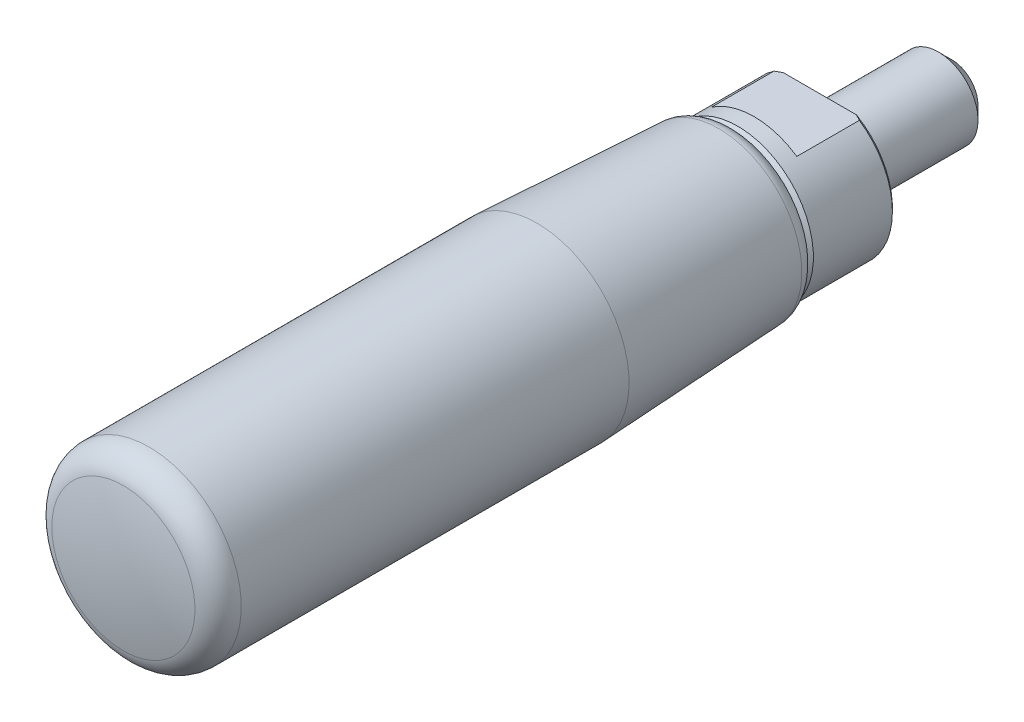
ISO-10303-21;
HEADER;
FILE_DESCRIPTION(('STEP AP214'),'2;1');
FILE_NAME('part.step','',(''),(''),'','','');
FILE_SCHEMA(('AUTOMOTIVE_DESIGN { 1 0 10303 214 1 1 1 1 }'));
ENDSEC;
DATA;
#1=APPLICATION_CONTEXT('core data for automotive mechanical design processes');
#2=APPLICATION_PROTOCOL_DEFINITION('international standard','automotive_design',2000,#1);
#3=PRODUCT_CONTEXT('',#1,'mechanical');
#4=PRODUCT('Part','Part','',(#3));
#5=PRODUCT_RELATED_PRODUCT_CATEGORY('part','',(#4));
#6=PRODUCT_DEFINITION_FORMATION('','',#4);
#7=PRODUCT_DEFINITION_CONTEXT('part definition',#1,'design');
#8=PRODUCT_DEFINITION('design','',#6,#7);
#9=PRODUCT_DEFINITION_SHAPE('','',#8);
#10=(LENGTH_UNIT() NAMED_UNIT(*) SI_UNIT(.MILLI.,.METRE.));
#11=(NAMED_UNIT(*) PLANE_ANGLE_UNIT() SI_UNIT($,.RADIAN.));
#12=(NAMED_UNIT(*) SI_UNIT($,.STERADIAN.) SOLID_ANGLE_UNIT());
#13=UNCERTAINTY_MEASURE_WITH_UNIT(LENGTH_MEASURE(1.E-05),#10,'distance_accuracy_value','');
#14=(GEOMETRIC_REPRESENTATION_CONTEXT(3) GLOBAL_UNCERTAINTY_ASSIGNED_CONTEXT((#13)) GLOBAL_UNIT_ASSIGNED_CONTEXT((#10,
#11,#12)) REPRESENTATION_CONTEXT('',''));
#15=CARTESIAN_POINT('',(0.,0.,0.));
#16=DIRECTION('',(0.,0.,1.));
#17=DIRECTION('',(1.,0.,0.));
#18=AXIS2_PLACEMENT_3D('',#15,#16,#17);
#19=CARTESIAN_POINT('',(0.,6.,0.));
#20=DIRECTION('',(0.,0.,-1.));
#21=DIRECTION('',(-1.,0.,0.));
#22=AXIS2_PLACEMENT_3D('',#19,#20,#21);
#23=PLANE('',#22);
#24=CARTESIAN_POINT('',(0.,0.,0.));
#25=DIRECTION('',(0.,0.,-1.));
#26=DIRECTION('',(-1.,0.,0.));
#27=AXIS2_PLACEMENT_3D('',#24,#25,#26);
#28=CIRCLE('',#27,6.);
#29=CARTESIAN_POINT('',(-6.,0.,0.));
#30=VERTEX_POINT('',#29);
#31=EDGE_CURVE('E170',#30,#30,#28,.T.);
#32=ORIENTED_EDGE('',*,*,#31,.F.);
#33=EDGE_LOOP('',(#32));
#34=FACE_BOUND('',#33,.T.);
#35=CARTESIAN_POINT('',(0.,0.,0.));
#36=DIRECTION('',(0.,0.,-1.));
#37=DIRECTION('',(-1.,0.,0.));
#38=AXIS2_PLACEMENT_3D('',#35,#36,#37);
#39=CIRCLE('',#38,11.);
#40=CARTESIAN_POINT('',(5.54526825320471,9.4999999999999,0.));
#41=VERTEX_POINT('',#40);
#42=CARTESIAN_POINT('',(5.54526825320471,-9.5,0.));
#43=VERTEX_POINT('',#42);
#44=EDGE_CURVE('E139',#41,#43,#39,.T.);
#45=ORIENTED_EDGE('',*,*,#44,.T.);
#46=DIRECTION('',(-1.,0.,0.));
#47=VECTOR('',#46,1.);
#48=CARTESIAN_POINT('',(0.,-9.5,0.));
#49=LINE('',#48,#47);
#50=CARTESIAN_POINT('',(-5.5452682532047,-9.5,0.));
#51=VERTEX_POINT('',#50);
#52=EDGE_CURVE('E79',#43,#51,#49,.T.);
#53=ORIENTED_EDGE('',*,*,#52,.T.);
#54=CARTESIAN_POINT('',(-5.54526825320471,9.4999999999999,0.));
#55=VERTEX_POINT('',#54);
#56=EDGE_CURVE('E37',#51,#55,#39,.T.);
#57=ORIENTED_EDGE('',*,*,#56,.T.);
#58=DIRECTION('',(-1.,0.,0.));
#59=VECTOR('',#58,1.);
#60=CARTESIAN_POINT('',(0.,9.4999999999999,0.));
#61=LINE('',#60,#59);
#62=EDGE_CURVE('E147',#41,#55,#61,.T.);
#63=ORIENTED_EDGE('',*,*,#62,.F.);
#64=EDGE_LOOP('',(#45,#53,#57,#63));
#65=FACE_BOUND('',#64,.T.);
#66=ADVANCED_FACE('F14',(#34,#65),#23,.T.);
#67=CARTESIAN_POINT('',(-1.04996420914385E-13,0.,-25.));
#68=DIRECTION('',(0.,0.,-1.));
#69=DIRECTION('',(-1.,0.,0.));
#70=AXIS2_PLACEMENT_3D('',#67,#68,#69);
#71=CYLINDRICAL_SURFACE('',#70,11.5);
#72=CARTESIAN_POINT('',(0.,0.,12.5));
#73=DIRECTION('',(0.,0.,-1.));
#74=DIRECTION('',(-1.,0.,0.));
#75=AXIS2_PLACEMENT_3D('',#72,#73,#74);
#76=CIRCLE('',#75,11.5);
#77=CARTESIAN_POINT('',(-11.4999999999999,0.,12.5));
#78=VERTEX_POINT('',#77);
#79=EDGE_CURVE('E153',#78,#78,#76,.T.);
#80=ORIENTED_EDGE('',*,*,#79,.T.);
#81=EDGE_LOOP('',(#80));
#82=FACE_BOUND('',#81,.T.);
#83=CARTESIAN_POINT('',(0.,0.,0.5));
#84=DIRECTION('',(0.,0.,-1.));
#85=DIRECTION('',(-1.,0.,0.));
#86=AXIS2_PLACEMENT_3D('',#83,#84,#85);
#87=CIRCLE('',#86,11.5);
#88=CARTESIAN_POINT('',(-6.48074069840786,-9.5,0.500000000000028));
#89=VERTEX_POINT('',#88);
#90=CARTESIAN_POINT('',(-6.48074069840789,9.4999999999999,0.499999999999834));
#91=VERTEX_POINT('',#90);
#92=EDGE_CURVE('E146',#89,#91,#87,.T.);
#93=ORIENTED_EDGE('',*,*,#92,.F.);
#94=DIRECTION('',(0.,0.,-1.));
#95=VECTOR('',#94,1.);
#96=CARTESIAN_POINT('',(-6.48074069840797,-9.5,-25.));
#97=LINE('',#96,#95);
#98=CARTESIAN_POINT('',(-6.48074069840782,-9.5,10.));
#99=VERTEX_POINT('',#98);
#100=EDGE_CURVE('E29',#89,#99,#97,.F.);
#101=ORIENTED_EDGE('',*,*,#100,.T.);
#102=CARTESIAN_POINT('',(0.,0.,10.));
#103=DIRECTION('',(0.,0.,1.));
#104=DIRECTION('',(0.,1.,0.));
#105=AXIS2_PLACEMENT_3D('',#102,#103,#104);
#106=CIRCLE('',#105,11.5);
#107=CARTESIAN_POINT('',(6.4807406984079,-9.5,9.99999999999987));
#108=VERTEX_POINT('',#107);
#109=EDGE_CURVE('E83',#108,#99,#106,.F.);
#110=ORIENTED_EDGE('',*,*,#109,.F.);
#111=DIRECTION('',(0.,0.,-1.));
#112=VECTOR('',#111,1.);
#113=CARTESIAN_POINT('',(6.48074069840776,-9.5,-25.));
#114=LINE('',#113,#112);
#115=CARTESIAN_POINT('',(6.4807406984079,-9.5,0.499999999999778));
#116=VERTEX_POINT('',#115);
#117=EDGE_CURVE('E68',#108,#116,#114,.T.);
#118=ORIENTED_EDGE('',*,*,#117,.T.);
#119=CARTESIAN_POINT('',(6.4807406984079,9.4999999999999,0.499999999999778));
#120=VERTEX_POINT('',#119);
#121=EDGE_CURVE('E151',#120,#116,#87,.T.);
#122=ORIENTED_EDGE('',*,*,#121,.F.);
#123=DIRECTION('',(0.,0.,-1.));
#124=VECTOR('',#123,1.);
#125=CARTESIAN_POINT('',(6.48074069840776,9.4999999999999,-25.));
#126=LINE('',#125,#124);
#127=CARTESIAN_POINT('',(6.4807406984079,9.4999999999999,9.99999999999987));
#128=VERTEX_POINT('',#127);
#129=EDGE_CURVE('E144',#128,#120,#126,.T.);
#130=ORIENTED_EDGE('',*,*,#129,.F.);
#131=CARTESIAN_POINT('',(0.,0.,10.));
#132=DIRECTION('',(0.,0.,-1.));
#133=DIRECTION('',(0.,-1.,0.));
#134=AXIS2_PLACEMENT_3D('',#131,#132,#133);
#135=CIRCLE('',#134,11.5);
#136=CARTESIAN_POINT('',(-6.48074069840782,9.4999999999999,10.));
#137=VERTEX_POINT('',#136);
#138=EDGE_CURVE('E132',#128,#137,#135,.F.);
#139=ORIENTED_EDGE('',*,*,#138,.T.);
#140=DIRECTION('',(0.,0.,-1.));
#141=VECTOR('',#140,1.);
#142=CARTESIAN_POINT('',(-6.48074069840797,9.4999999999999,-25.));
#143=LINE('',#142,#141);
#144=EDGE_CURVE('E235',#91,#137,#143,.F.);
#145=ORIENTED_EDGE('',*,*,#144,.F.);
#146=EDGE_LOOP('',(#93,#101,#110,#118,#122,#130,#139,#145));
#147=FACE_BOUND('',#146,.T.);
#148=ADVANCED_FACE('F86',(#82,#147),#71,.T.);
#149=CARTESIAN_POINT('',(0.,0.,0.5));
#150=DIRECTION('',(0.,0.,1.));
#151=DIRECTION('',(1.,0.,0.));
#152=AXIS2_PLACEMENT_3D('',#149,#150,#151);
#153=CONICAL_SURFACE('',#152,11.5,0.785398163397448);
#154=CARTESIAN_POINT('',(2.6150436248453,-9.5,-1.1466526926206));
#155=CARTESIAN_POINT('',(2.81563188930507,-9.5,-1.0934217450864));
#156=CARTESIAN_POINT('',(3.01473887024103,-9.5,-1.03488173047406));
#157=CARTESIAN_POINT('',(3.40980529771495,-9.5,-0.908329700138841));
#158=CARTESIAN_POINT('',(3.60576644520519,-9.5,-0.840323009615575));
#159=CARTESIAN_POINT('',(4.18777598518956,-9.5,-0.624171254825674));
#160=CARTESIAN_POINT('',(4.56920172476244,-9.5,-0.463548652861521));
#161=CARTESIAN_POINT('',(5.31721943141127,-9.5,-0.118204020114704));
#162=CARTESIAN_POINT('',(5.68390242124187,-9.5,0.0663246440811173));
#163=CARTESIAN_POINT('',(6.2262889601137,-9.5,0.357529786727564));
#164=CARTESIAN_POINT('',(6.4058912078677,-9.5,0.457048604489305));
#165=CARTESIAN_POINT('',(6.76270089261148,-9.5,0.660300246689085));
#166=CARTESIAN_POINT('',(6.93990829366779,-9.5,0.764033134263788));
#167=CARTESIAN_POINT('',(7.36366995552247,-9.5,1.01808323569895));
#168=CARTESIAN_POINT('',(7.60914328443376,-9.5,1.17020184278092));
#169=CARTESIAN_POINT('',(8.09622136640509,-9.5,1.48052793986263));
#170=CARTESIAN_POINT('',(8.33782582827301,-9.5,1.63873588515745));
#171=CARTESIAN_POINT('',(8.81766580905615,-9.5,1.96030498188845));
#172=CARTESIAN_POINT('',(9.05590042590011,-9.5,2.1236674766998));
#173=CARTESIAN_POINT('',(9.52934102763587,-9.5,2.45472976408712));
#174=CARTESIAN_POINT('',(9.76454690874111,-9.5,2.62242970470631));
#175=CARTESIAN_POINT('',(10.4668157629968,-9.5,3.13151778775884));
#176=CARTESIAN_POINT('',(10.92986612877,-9.5,3.47844413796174));
#177=CARTESIAN_POINT('',(11.8474959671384,-9.5,4.183117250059));
#178=CARTESIAN_POINT('',(12.3020766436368,-9.5,4.5408624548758));
#179=CARTESIAN_POINT('',(13.2154590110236,-9.5,5.27335739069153));
#180=CARTESIAN_POINT('',(13.6740983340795,-9.5,5.6483091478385));
#181=CARTESIAN_POINT('',(14.5858281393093,-9.5,6.40493510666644));
#182=CARTESIAN_POINT('',(15.038918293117,-9.5,6.78660970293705));
#183=CARTESIAN_POINT('',(15.9386408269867,-9.5,7.55357697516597));
#184=CARTESIAN_POINT('',(16.3852926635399,-9.5,7.93884685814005));
#185=CARTESIAN_POINT('',(17.052492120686,-9.5,8.51987658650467));
#186=CARTESIAN_POINT('',(17.2744147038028,-9.5,8.71406138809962));
#187=CARTESIAN_POINT('',(17.7174228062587,-9.5,9.1033806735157));
#188=CARTESIAN_POINT('',(17.938508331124,-9.5,9.29851515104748));
#189=CARTESIAN_POINT('',(18.1592164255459,-9.5,9.49407575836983));
#190=B_SPLINE_CURVE_WITH_KNOTS('',3,(#154,#155,#156,#157,#158,#159,#160,#161,#162,#163,#164,
#165,#166,#167,#168,#169,#170,#171,#172,#173,#174,#175,#176,#177,#178,#179,#180,#181,#182,#183,
#184,#185,#186,#187,#188,#189),.UNSPECIFIED.,.F.,.F.,(4,2,2,2,2,2,2,2,2,2,2,2,2,2,2,2,2,4),(0.,
0.622411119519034,1.24447352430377,2.48471844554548,3.71549389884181,4.33144062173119,
4.9473965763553,5.81364198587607,6.67995229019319,7.54649026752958,8.41305786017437,
10.1485978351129,11.8838892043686,13.6610078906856,15.4382312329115,17.2077667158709,
18.0924206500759,18.977068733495),.UNSPECIFIED.);
#191=EDGE_CURVE('E73',#43,#116,#190,.T.);
#192=ORIENTED_EDGE('',*,*,#191,.F.);
#193=ORIENTED_EDGE('',*,*,#44,.F.);
#194=CARTESIAN_POINT('',(2.6150436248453,9.4999999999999,-1.1466526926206));
#195=CARTESIAN_POINT('',(2.81563188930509,9.4999999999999,-1.09342174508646));
#196=CARTESIAN_POINT('',(3.01473887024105,9.4999999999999,-1.03488173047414));
#197=CARTESIAN_POINT('',(3.40980529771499,9.4999999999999,-0.908329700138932));
#198=CARTESIAN_POINT('',(3.60576644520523,9.4999999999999,-0.840323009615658));
#199=CARTESIAN_POINT('',(4.18777598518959,9.4999999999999,-0.624171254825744));
#200=CARTESIAN_POINT('',(4.56920172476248,9.4999999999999,-0.463548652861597));
#201=CARTESIAN_POINT('',(5.3172194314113,9.4999999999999,-0.118204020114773));
#202=CARTESIAN_POINT('',(5.6839024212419,9.4999999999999,0.0663246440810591));
#203=CARTESIAN_POINT('',(6.22628896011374,9.4999999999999,0.357529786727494));
#204=CARTESIAN_POINT('',(6.40589120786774,9.4999999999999,0.457048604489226));
#205=CARTESIAN_POINT('',(6.76270089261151,9.4999999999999,0.660300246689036));
#206=CARTESIAN_POINT('',(6.9399082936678,9.4999999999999,0.76403313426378));
#207=CARTESIAN_POINT('',(7.36366995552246,9.4999999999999,1.01808323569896));
#208=CARTESIAN_POINT('',(7.60914328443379,9.4999999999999,1.17020184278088));
#209=CARTESIAN_POINT('',(8.09622136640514,9.4999999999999,1.48052793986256));
#210=CARTESIAN_POINT('',(8.33782582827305,9.4999999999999,1.6387358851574));
#211=CARTESIAN_POINT('',(8.81766580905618,9.4999999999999,1.96030498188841));
#212=CARTESIAN_POINT('',(9.05590042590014,9.4999999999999,2.12366747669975));
#213=CARTESIAN_POINT('',(9.52934102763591,9.4999999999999,2.45472976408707));
#214=CARTESIAN_POINT('',(9.76454690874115,9.4999999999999,2.62242970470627));
#215=CARTESIAN_POINT('',(10.4668157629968,9.4999999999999,3.1315177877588));
#216=CARTESIAN_POINT('',(10.9298661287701,9.4999999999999,3.47844413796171));
#217=CARTESIAN_POINT('',(11.8474959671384,9.4999999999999,4.18311725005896));
#218=CARTESIAN_POINT('',(12.3020766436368,9.4999999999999,4.54086245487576));
#219=CARTESIAN_POINT('',(13.2154590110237,9.4999999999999,5.2733573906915));
#220=CARTESIAN_POINT('',(13.6740983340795,9.4999999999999,5.64830914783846));
#221=CARTESIAN_POINT('',(14.5858281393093,9.4999999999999,6.4049351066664));
#222=CARTESIAN_POINT('',(15.038918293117,9.4999999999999,6.78660970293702));
#223=CARTESIAN_POINT('',(15.9386408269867,9.4999999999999,7.55357697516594));
#224=CARTESIAN_POINT('',(16.3852926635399,9.4999999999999,7.93884685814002));
#225=CARTESIAN_POINT('',(17.052492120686,9.4999999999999,8.51987658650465));
#226=CARTESIAN_POINT('',(17.2744147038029,9.4999999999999,8.71406138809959));
#227=CARTESIAN_POINT('',(17.7174228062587,9.4999999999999,9.10338067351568));
#228=CARTESIAN_POINT('',(17.938508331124,9.4999999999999,9.29851515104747));
#229=CARTESIAN_POINT('',(18.1592164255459,9.4999999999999,9.49407575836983));
#230=B_SPLINE_CURVE_WITH_KNOTS('',3,(#194,#195,#196,#197,#198,#199,#200,#201,#202,#203,#204,
#205,#206,#207,#208,#209,#210,#211,#212,#213,#214,#215,#216,#217,#218,#219,#220,#221,#222,#223,
#224,#225,#226,#227,#228,#229),.UNSPECIFIED.,.F.,.F.,(4,2,2,2,2,2,2,2,2,2,2,2,2,2,2,2,2,4),(0.,
0.622411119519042,1.24447352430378,2.4847184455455,3.71549389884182,4.33144062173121,
4.94739657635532,5.81364198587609,6.67995229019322,7.54649026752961,8.4130578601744,
10.1485978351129,11.8838892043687,13.6610078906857,15.4382312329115,17.2077667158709,
18.0924206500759,18.977068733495),.UNSPECIFIED.);
#231=EDGE_CURVE('E126',#41,#120,#230,.T.);
#232=ORIENTED_EDGE('',*,*,#231,.T.);
#233=ORIENTED_EDGE('',*,*,#121,.T.);
#234=EDGE_LOOP('',(#192,#193,#232,#233));
#235=FACE_BOUND('',#234,.T.);
#236=ADVANCED_FACE('F103',(#235),#153,.T.);
#237=CARTESIAN_POINT('',(-18.1592164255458,-9.5,9.49407575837));
#238=CARTESIAN_POINT('',(-17.9385083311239,-9.5,9.29851515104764));
#239=CARTESIAN_POINT('',(-17.7174228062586,-9.5,9.10338067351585));
#240=CARTESIAN_POINT('',(-17.2744147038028,-9.5,8.71406138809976));
#241=CARTESIAN_POINT('',(-17.0524921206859,-9.5,8.51987658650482));
#242=CARTESIAN_POINT('',(-16.3852926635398,-9.5,7.93884685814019));
#243=CARTESIAN_POINT('',(-15.9386408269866,-9.5,7.5535769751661));
#244=CARTESIAN_POINT('',(-15.0389182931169,-9.5,6.78660970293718));
#245=CARTESIAN_POINT('',(-14.5858281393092,-9.5,6.40493510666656));
#246=CARTESIAN_POINT('',(-13.6740983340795,-9.5,5.64830914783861));
#247=CARTESIAN_POINT('',(-13.2154590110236,-9.5,5.27335739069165));
#248=CARTESIAN_POINT('',(-12.3020766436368,-9.5,4.5408624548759));
#249=CARTESIAN_POINT('',(-11.8474959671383,-9.5,4.1831172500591));
#250=CARTESIAN_POINT('',(-10.92986612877,-9.5,3.47844413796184));
#251=CARTESIAN_POINT('',(-10.4668157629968,-9.5,3.13151778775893));
#252=CARTESIAN_POINT('',(-9.76454690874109,-9.5,2.62242970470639));
#253=CARTESIAN_POINT('',(-9.52934102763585,-9.5,2.4547297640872));
#254=CARTESIAN_POINT('',(-9.05590042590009,-9.5,2.12366747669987));
#255=CARTESIAN_POINT('',(-8.81766580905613,-9.5,1.96030498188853));
#256=CARTESIAN_POINT('',(-8.337825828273,-9.5,1.63873588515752));
#257=CARTESIAN_POINT('',(-8.09622136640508,-9.5,1.4805279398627));
#258=CARTESIAN_POINT('',(-7.60914328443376,-9.5,1.17020184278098));
#259=CARTESIAN_POINT('',(-7.36366995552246,-9.5,1.018083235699));
#260=CARTESIAN_POINT('',(-6.93990829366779,-9.5,0.764033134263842));
#261=CARTESIAN_POINT('',(-6.76270089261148,-9.5,0.66030024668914));
#262=CARTESIAN_POINT('',(-6.40589120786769,-9.5,0.457048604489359));
#263=CARTESIAN_POINT('',(-6.2262889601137,-9.5,0.357529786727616));
#264=CARTESIAN_POINT('',(-5.68390242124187,-9.5,0.0663246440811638));
#265=CARTESIAN_POINT('',(-5.31721943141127,-9.5,-0.118204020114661));
#266=CARTESIAN_POINT('',(-4.56920172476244,-9.5,-0.463548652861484));
#267=CARTESIAN_POINT('',(-4.18777598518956,-9.5,-0.62417125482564));
#268=CARTESIAN_POINT('',(-3.60576644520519,-9.5,-0.840323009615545));
#269=CARTESIAN_POINT('',(-3.40980529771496,-9.5,-0.908329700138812));
#270=CARTESIAN_POINT('',(-3.01473887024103,-9.5,-1.03488173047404));
#271=CARTESIAN_POINT('',(-2.81563188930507,-9.5,-1.09342174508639));
#272=CARTESIAN_POINT('',(-2.61504362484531,-9.5,-1.1466526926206));
#273=B_SPLINE_CURVE_WITH_KNOTS('',3,(#237,#238,#239,#240,#241,#242,#243,#244,#245,#246,#247,
#248,#249,#250,#251,#252,#253,#254,#255,#256,#257,#258,#259,#260,#261,#262,#263,#264,#265,#266,
#267,#268,#269,#270,#271,#272),.UNSPECIFIED.,.F.,.F.,(4,2,2,2,2,2,2,2,2,2,2,2,2,2,2,2,2,4),(0.,
0.884648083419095,1.76930201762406,3.5388375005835,5.31606084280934,7.09317952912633,
8.82847089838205,10.5640108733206,11.4305784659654,12.2971164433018,13.1634267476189,
14.0296721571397,14.6456281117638,15.2615748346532,16.4923502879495,17.7325952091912,
18.3546576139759,18.977068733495),.UNSPECIFIED.);
#274=EDGE_CURVE('E89',#89,#51,#273,.T.);
#275=ORIENTED_EDGE('',*,*,#274,.F.);
#276=ORIENTED_EDGE('',*,*,#92,.T.);
#277=CARTESIAN_POINT('',(-18.1592164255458,9.4999999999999,9.49407575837));
#278=CARTESIAN_POINT('',(-17.938508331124,9.4999999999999,9.29851515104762));
#279=CARTESIAN_POINT('',(-17.7174228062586,9.4999999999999,9.10338067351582));
#280=CARTESIAN_POINT('',(-17.2744147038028,9.4999999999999,8.71406138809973));
#281=CARTESIAN_POINT('',(-17.0524921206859,9.4999999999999,8.51987658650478));
#282=CARTESIAN_POINT('',(-16.3852926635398,9.4999999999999,7.93884685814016));
#283=CARTESIAN_POINT('',(-15.9386408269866,9.4999999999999,7.55357697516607));
#284=CARTESIAN_POINT('',(-15.0389182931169,9.4999999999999,6.78660970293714));
#285=CARTESIAN_POINT('',(-14.5858281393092,9.4999999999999,6.40493510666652));
#286=CARTESIAN_POINT('',(-13.6740983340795,9.4999999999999,5.64830914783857));
#287=CARTESIAN_POINT('',(-13.2154590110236,9.4999999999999,5.27335739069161));
#288=CARTESIAN_POINT('',(-12.3020766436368,9.4999999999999,4.54086245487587));
#289=CARTESIAN_POINT('',(-11.8474959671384,9.4999999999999,4.18311725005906));
#290=CARTESIAN_POINT('',(-10.9298661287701,9.4999999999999,3.4784441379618));
#291=CARTESIAN_POINT('',(-10.4668157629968,9.4999999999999,3.13151778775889));
#292=CARTESIAN_POINT('',(-9.76454690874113,9.4999999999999,2.62242970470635));
#293=CARTESIAN_POINT('',(-9.5293410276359,9.4999999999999,2.45472976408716));
#294=CARTESIAN_POINT('',(-9.05590042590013,9.4999999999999,2.12366747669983));
#295=CARTESIAN_POINT('',(-8.81766580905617,9.4999999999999,1.96030498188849));
#296=CARTESIAN_POINT('',(-8.33782582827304,9.4999999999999,1.63873588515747));
#297=CARTESIAN_POINT('',(-8.09622136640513,9.4999999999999,1.48052793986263));
#298=CARTESIAN_POINT('',(-7.60914328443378,9.4999999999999,1.17020184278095));
#299=CARTESIAN_POINT('',(-7.36366995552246,9.4999999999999,1.01808323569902));
#300=CARTESIAN_POINT('',(-6.9399082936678,9.4999999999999,0.764033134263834));
#301=CARTESIAN_POINT('',(-6.7627008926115,9.4999999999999,0.660300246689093));
#302=CARTESIAN_POINT('',(-6.40589120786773,9.4999999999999,0.457048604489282));
#303=CARTESIAN_POINT('',(-6.22628896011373,9.4999999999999,0.357529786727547));
#304=CARTESIAN_POINT('',(-5.6839024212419,9.4999999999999,0.0663246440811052));
#305=CARTESIAN_POINT('',(-5.3172194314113,9.4999999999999,-0.11820402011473));
#306=CARTESIAN_POINT('',(-4.56920172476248,9.4999999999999,-0.46354865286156));
#307=CARTESIAN_POINT('',(-4.18777598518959,9.4999999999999,-0.624171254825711));
#308=CARTESIAN_POINT('',(-3.60576644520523,9.4999999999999,-0.840323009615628));
#309=CARTESIAN_POINT('',(-3.40980529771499,9.4999999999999,-0.908329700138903));
#310=CARTESIAN_POINT('',(-3.01473887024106,9.4999999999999,-1.03488173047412));
#311=CARTESIAN_POINT('',(-2.81563188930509,9.4999999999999,-1.09342174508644));
#312=CARTESIAN_POINT('',(-2.61504362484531,9.4999999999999,-1.1466526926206));
#313=B_SPLINE_CURVE_WITH_KNOTS('',3,(#277,#278,#279,#280,#281,#282,#283,#284,#285,#286,#287,
#288,#289,#290,#291,#292,#293,#294,#295,#296,#297,#298,#299,#300,#301,#302,#303,#304,#305,#306,
#307,#308,#309,#310,#311,#312),.UNSPECIFIED.,.F.,.F.,(4,2,2,2,2,2,2,2,2,2,2,2,2,2,2,2,2,4),(0.,
0.884648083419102,1.76930201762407,3.53883750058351,5.31606084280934,7.09317952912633,
8.82847089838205,10.5640108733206,11.4305784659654,12.2971164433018,13.1634267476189,
14.0296721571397,14.6456281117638,15.2615748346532,16.4923502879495,17.7325952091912,
18.354657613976,18.977068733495),.UNSPECIFIED.);
#314=EDGE_CURVE('E119',#91,#55,#313,.T.);
#315=ORIENTED_EDGE('',*,*,#314,.T.);
#316=ORIENTED_EDGE('',*,*,#56,.F.);
#317=EDGE_LOOP('',(#275,#276,#315,#316));
#318=FACE_BOUND('',#317,.T.);
#319=ADVANCED_FACE('F142',(#318),#153,.T.);
#320=CARTESIAN_POINT('',(-1.04996420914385E-13,0.,-25.));
#321=DIRECTION('',(0.,0.,-1.));
#322=DIRECTION('',(-1.,0.,0.));
#323=AXIS2_PLACEMENT_3D('',#320,#321,#322);
#324=CYLINDRICAL_SURFACE('',#323,6.);
#325=CARTESIAN_POINT('',(0.,0.,-18.));
#326=DIRECTION('',(0.,0.,-1.));
#327=DIRECTION('',(-1.,0.,0.));
#328=AXIS2_PLACEMENT_3D('',#325,#326,#327);
#329=CIRCLE('',#328,6.);
#330=CARTESIAN_POINT('',(-6.00000000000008,0.,-18.));
#331=VERTEX_POINT('',#330);
#332=EDGE_CURVE('E9',#331,#331,#329,.F.);
#333=ORIENTED_EDGE('',*,*,#332,.T.);
#334=EDGE_LOOP('',(#333));
#335=FACE_BOUND('',#334,.T.);
#336=ORIENTED_EDGE('',*,*,#31,.T.);
#337=EDGE_LOOP('',(#336));
#338=FACE_BOUND('',#337,.T.);
#339=ADVANCED_FACE('F174',(#335,#338),#324,.T.);
#340=CARTESIAN_POINT('',(0.,0.,-20.));
#341=DIRECTION('',(0.,0.,-1.));
#342=DIRECTION('',(-1.,0.,0.));
#343=AXIS2_PLACEMENT_3D('',#340,#341,#342);
#344=PLANE('',#343);
#345=CARTESIAN_POINT('',(0.,0.,-20.));
#346=DIRECTION('',(0.,0.,-1.));
#347=DIRECTION('',(-1.,0.,0.));
#348=AXIS2_PLACEMENT_3D('',#345,#346,#347);
#349=CIRCLE('',#348,4.);
#350=CARTESIAN_POINT('',(-4.00000000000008,0.,-20.));
#351=VERTEX_POINT('',#350);
#352=EDGE_CURVE('E22',#351,#351,#349,.T.);
#353=ORIENTED_EDGE('',*,*,#352,.T.);
#354=EDGE_LOOP('',(#353));
#355=FACE_BOUND('',#354,.T.);
#356=ADVANCED_FACE('F186',(#355),#344,.T.);
#357=CARTESIAN_POINT('',(2.39391839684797E-13,0.,57.));
#358=DIRECTION('',(-1.,0.,0.));
#359=DIRECTION('',(0.,0.,1.));
#360=AXIS2_PLACEMENT_3D('',#357,#358,#359);
#361=SPHERICAL_SURFACE('',#360,50.);
#362=CARTESIAN_POINT('',(2.39391839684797E-13,0.,57.));
#363=DIRECTION('',(0.,0.,-1.));
#364=DIRECTION('',(-1.,0.,0.));
#365=AXIS2_PLACEMENT_3D('',#362,#363,#364);
#366=SPHERICAL_SURFACE('',#365,50.);
#367=CARTESIAN_POINT('',(4.44362605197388E-13,0.,105.804226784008));
#368=DIRECTION('',(0.,0.,-1.));
#369=DIRECTION('',(-1.,0.,0.));
#370=AXIS2_PLACEMENT_3D('',#367,#368,#369);
#371=CIRCLE('',#370,10.8695652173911);
#372=CARTESIAN_POINT('',(-10.8695652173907,0.,105.804226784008));
#373=VERTEX_POINT('',#372);
#374=EDGE_CURVE('E168',#373,#373,#371,.T.);
#375=ORIENTED_EDGE('',*,*,#374,.F.);
#376=EDGE_LOOP('',(#375));
#377=FACE_BOUND('',#376,.T.);
#378=ADVANCED_FACE('F190',(#377),#366,.T.);
#379=CARTESIAN_POINT('',(4.27964943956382E-13,0.,101.899888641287));
#380=DIRECTION('',(0.,0.,-1.));
#381=DIRECTION('',(-1.,0.,0.));
#382=AXIS2_PLACEMENT_3D('',#379,#380,#381);
#383=TOROIDAL_SURFACE('',#382,9.99999999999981,4.);
#384=CARTESIAN_POINT('',(4.27964943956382E-13,0.,101.899888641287));
#385=DIRECTION('',(0.,0.,-1.));
#386=DIRECTION('',(-1.,0.,0.));
#387=AXIS2_PLACEMENT_3D('',#384,#385,#386);
#388=CIRCLE('',#387,13.9999999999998);
#389=CARTESIAN_POINT('',(-13.9999999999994,0.,101.899888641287));
#390=VERTEX_POINT('',#389);
#391=EDGE_CURVE('E165',#390,#390,#388,.T.);
#392=ORIENTED_EDGE('',*,*,#391,.F.);
#393=EDGE_LOOP('',(#392));
#394=FACE_BOUND('',#393,.T.);
#395=ORIENTED_EDGE('',*,*,#374,.T.);
#396=EDGE_LOOP('',(#395));
#397=FACE_BOUND('',#396,.T.);
#398=ADVANCED_FACE('F194',(#394,#397),#383,.T.);
#399=CARTESIAN_POINT('',(-1.04996420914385E-13,0.,-25.));
#400=DIRECTION('',(0.,0.,-1.));
#401=DIRECTION('',(-1.,0.,0.));
#402=AXIS2_PLACEMENT_3D('',#399,#400,#401);
#403=CYLINDRICAL_SURFACE('',#402,13.9999999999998);
#404=CARTESIAN_POINT('',(1.80593843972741E-13,0.,43.));
#405=DIRECTION('',(0.,0.,-1.));
#406=DIRECTION('',(-1.,0.,0.));
#407=AXIS2_PLACEMENT_3D('',#404,#405,#406);
#408=CIRCLE('',#407,13.9999999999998);
#409=CARTESIAN_POINT('',(-13.9999999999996,0.,43.));
#410=VERTEX_POINT('',#409);
#411=EDGE_CURVE('E162',#410,#410,#408,.T.);
#412=ORIENTED_EDGE('',*,*,#411,.F.);
#413=EDGE_LOOP('',(#412));
#414=FACE_BOUND('',#413,.T.);
#415=ORIENTED_EDGE('',*,*,#391,.T.);
#416=EDGE_LOOP('',(#415));
#417=FACE_BOUND('',#416,.T.);
#418=ADVANCED_FACE('F198',(#414,#417),#403,.T.);
#419=CARTESIAN_POINT('',(1.80593843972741E-13,0.,43.));
#420=DIRECTION('',(0.,0.,1.));
#421=DIRECTION('',(1.,0.,0.));
#422=AXIS2_PLACEMENT_3D('',#419,#420,#421);
#423=CONICAL_SURFACE('',#422,13.9999999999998,0.0499583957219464);
#424=CARTESIAN_POINT('',(0.,0.,15.3751559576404));
#425=DIRECTION('',(0.,0.,-1.));
#426=DIRECTION('',(-1.,0.,0.));
#427=AXIS2_PLACEMENT_3D('',#424,#425,#426);
#428=CIRCLE('',#427,12.6187577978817);
#429=CARTESIAN_POINT('',(-12.6187577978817,0.,15.3751559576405));
#430=VERTEX_POINT('',#429);
#431=EDGE_CURVE('E159',#430,#430,#428,.T.);
#432=ORIENTED_EDGE('',*,*,#431,.F.);
#433=EDGE_LOOP('',(#432));
#434=FACE_BOUND('',#433,.T.);
#435=ORIENTED_EDGE('',*,*,#411,.T.);
#436=EDGE_LOOP('',(#435));
#437=FACE_BOUND('',#436,.T.);
#438=ADVANCED_FACE('F202',(#434,#437),#423,.T.);
#439=CARTESIAN_POINT('',(0.,0.,15.5));
#440=DIRECTION('',(0.,0.,-1.));
#441=DIRECTION('',(-1.,0.,0.));
#442=AXIS2_PLACEMENT_3D('',#439,#440,#441);
#443=TOROIDAL_SURFACE('',#442,10.1218769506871,2.5);
#444=CARTESIAN_POINT('',(0.,0.,13.1182722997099));
#445=DIRECTION('',(0.,0.,-1.));
#446=DIRECTION('',(-1.,0.,0.));
#447=AXIS2_PLACEMENT_3D('',#444,#445,#446);
#448=CIRCLE('',#447,10.8817277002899);
#449=CARTESIAN_POINT('',(-10.8817277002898,0.,13.1182722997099));
#450=VERTEX_POINT('',#449);
#451=EDGE_CURVE('E156',#450,#450,#448,.T.);
#452=ORIENTED_EDGE('',*,*,#451,.F.);
#453=EDGE_LOOP('',(#452));
#454=FACE_BOUND('',#453,.T.);
#455=ORIENTED_EDGE('',*,*,#431,.T.);
#456=EDGE_LOOP('',(#455));
#457=FACE_BOUND('',#456,.T.);
#458=ADVANCED_FACE('F206',(#454,#457),#443,.T.);
#459=CARTESIAN_POINT('',(0.,0.,12.5));
#460=DIRECTION('',(0.,0.,-1.));
#461=DIRECTION('',(-1.,0.,0.));
#462=AXIS2_PLACEMENT_3D('',#459,#460,#461);
#463=CONICAL_SURFACE('',#462,11.5,0.785398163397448);
#464=ORIENTED_EDGE('',*,*,#451,.T.);
#465=EDGE_LOOP('',(#464));
#466=FACE_BOUND('',#465,.T.);
#467=ORIENTED_EDGE('',*,*,#79,.F.);
#468=EDGE_LOOP('',(#467));
#469=FACE_BOUND('',#468,.T.);
#470=ADVANCED_FACE('F210',(#466,#469),#463,.T.);
#471=CARTESIAN_POINT('',(10.,13.5878618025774,9.99999999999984));
#472=DIRECTION('',(0.,0.,-1.));
#473=DIRECTION('',(0.,-1.,0.));
#474=AXIS2_PLACEMENT_3D('',#471,#472,#473);
#475=PLANE('',#474);
#476=DIRECTION('',(-1.,0.,0.));
#477=VECTOR('',#476,1.);
#478=CARTESIAN_POINT('',(10.,9.4999999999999,9.99999999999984));
#479=LINE('',#478,#477);
#480=EDGE_CURVE('E78',#128,#137,#479,.T.);
#481=ORIENTED_EDGE('',*,*,#480,.T.);
#482=ORIENTED_EDGE('',*,*,#138,.F.);
#483=EDGE_LOOP('',(#481,#482));
#484=FACE_BOUND('',#483,.T.);
#485=ADVANCED_FACE('F115',(#484),#475,.T.);
#486=CARTESIAN_POINT('',(10.,9.4999999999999,-2.99392823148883));
#487=DIRECTION('',(0.,-1.,0.));
#488=DIRECTION('',(1.,0.,0.));
#489=AXIS2_PLACEMENT_3D('',#486,#487,#488);
#490=PLANE('',#489);
#491=ORIENTED_EDGE('',*,*,#129,.T.);
#492=ORIENTED_EDGE('',*,*,#231,.F.);
#493=ORIENTED_EDGE('',*,*,#62,.T.);
#494=ORIENTED_EDGE('',*,*,#314,.F.);
#495=ORIENTED_EDGE('',*,*,#144,.T.);
#496=ORIENTED_EDGE('',*,*,#480,.F.);
#497=EDGE_LOOP('',(#491,#492,#493,#494,#495,#496));
#498=FACE_BOUND('',#497,.T.);
#499=ADVANCED_FACE('F111',(#498),#490,.F.);
#500=CARTESIAN_POINT('',(10.,-9.5,-2.99392823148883));
#501=DIRECTION('',(0.,-1.,0.));
#502=DIRECTION('',(1.,0.,0.));
#503=AXIS2_PLACEMENT_3D('',#500,#501,#502);
#504=PLANE('',#503);
#505=DIRECTION('',(-1.,0.,0.));
#506=VECTOR('',#505,1.);
#507=CARTESIAN_POINT('',(10.,-9.5,9.99999999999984));
#508=LINE('',#507,#506);
#509=EDGE_CURVE('E71',#108,#99,#508,.T.);
#510=ORIENTED_EDGE('',*,*,#509,.T.);
#511=ORIENTED_EDGE('',*,*,#100,.F.);
#512=ORIENTED_EDGE('',*,*,#274,.T.);
#513=ORIENTED_EDGE('',*,*,#52,.F.);
#514=ORIENTED_EDGE('',*,*,#191,.T.);
#515=ORIENTED_EDGE('',*,*,#117,.F.);
#516=EDGE_LOOP('',(#510,#511,#512,#513,#514,#515));
#517=FACE_BOUND('',#516,.T.);
#518=ADVANCED_FACE('F70',(#517),#504,.T.);
#519=CARTESIAN_POINT('',(10.,-13.5878618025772,9.99999999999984));
#520=DIRECTION('',(0.,0.,1.));
#521=DIRECTION('',(0.,1.,0.));
#522=AXIS2_PLACEMENT_3D('',#519,#520,#521);
#523=PLANE('',#522);
#524=ORIENTED_EDGE('',*,*,#109,.T.);
#525=ORIENTED_EDGE('',*,*,#509,.F.);
#526=EDGE_LOOP('',(#524,#525));
#527=FACE_BOUND('',#526,.T.);
#528=ADVANCED_FACE('F82',(#527),#523,.F.);
#529=CARTESIAN_POINT('',(0.,0.,-20.));
#530=DIRECTION('',(0.,0.,1.));
#531=DIRECTION('',(1.,0.,0.));
#532=AXIS2_PLACEMENT_3D('',#529,#530,#531);
#533=CONICAL_SURFACE('',#532,4.,0.785398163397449);
#534=ORIENTED_EDGE('',*,*,#332,.F.);
#535=EDGE_LOOP('',(#534));
#536=FACE_BOUND('',#535,.T.);
#537=ORIENTED_EDGE('',*,*,#352,.F.);
#538=EDGE_LOOP('',(#537));
#539=FACE_BOUND('',#538,.T.);
#540=ADVANCED_FACE('F16',(#536,#539),#533,.T.);
#541=CLOSED_SHELL('',(#66,#148,#236,#319,#339,#356,#378,#398,#418,#438,#458,#470,#485,#499,#518,
#528,#540));
#542=MANIFOLD_SOLID_BREP('B1',#541);
#543=ADVANCED_BREP_SHAPE_REPRESENTATION('',(#18,#542),#14);
#544=SHAPE_DEFINITION_REPRESENTATION(#9,#543);
ENDSEC;
END-ISO-10303-21;
